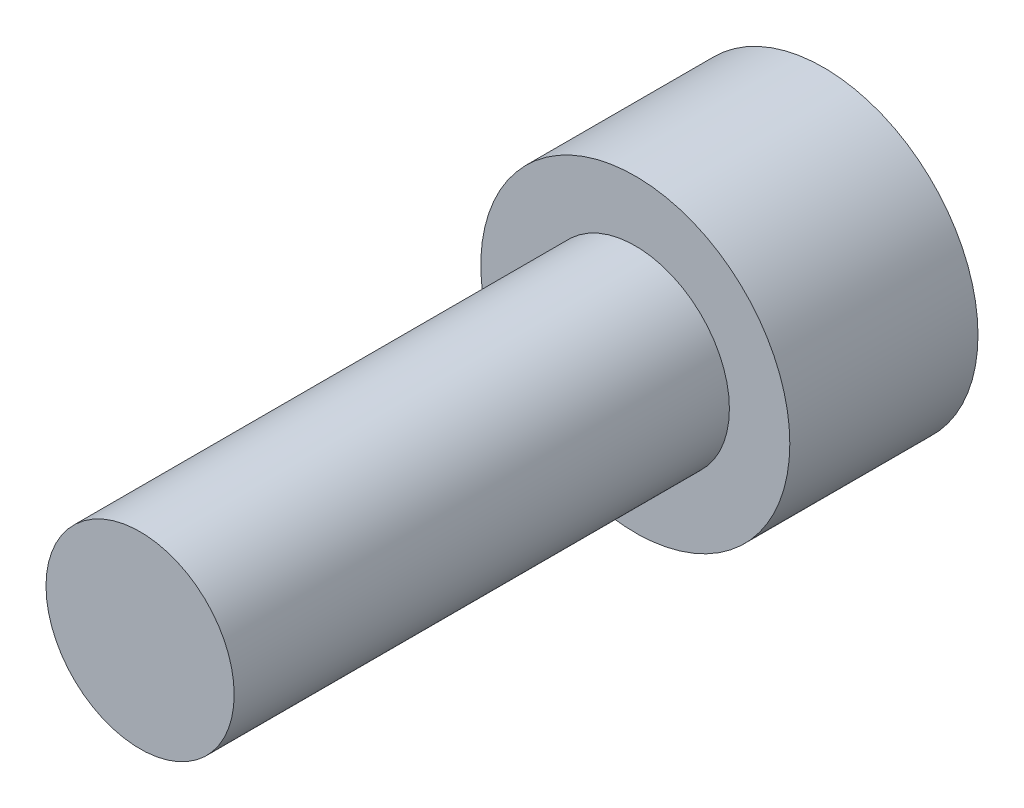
ISO-10303-21;
HEADER;
FILE_DESCRIPTION(('STEP AP214'),'2;1');
FILE_NAME('part.step','',(''),(''),'','','');
FILE_SCHEMA(('AUTOMOTIVE_DESIGN { 1 0 10303 214 1 1 1 1 }'));
ENDSEC;
DATA;
#1=APPLICATION_CONTEXT('core data for automotive mechanical design processes');
#2=APPLICATION_PROTOCOL_DEFINITION('international standard','automotive_design',2000,#1);
#3=PRODUCT_CONTEXT('',#1,'mechanical');
#4=PRODUCT('Part','Part','',(#3));
#5=PRODUCT_RELATED_PRODUCT_CATEGORY('part','',(#4));
#6=PRODUCT_DEFINITION_FORMATION('','',#4);
#7=PRODUCT_DEFINITION_CONTEXT('part definition',#1,'design');
#8=PRODUCT_DEFINITION('design','',#6,#7);
#9=PRODUCT_DEFINITION_SHAPE('','',#8);
#10=(LENGTH_UNIT() NAMED_UNIT(*) SI_UNIT(.MILLI.,.METRE.));
#11=(NAMED_UNIT(*) PLANE_ANGLE_UNIT() SI_UNIT($,.RADIAN.));
#12=(NAMED_UNIT(*) SI_UNIT($,.STERADIAN.) SOLID_ANGLE_UNIT());
#13=UNCERTAINTY_MEASURE_WITH_UNIT(LENGTH_MEASURE(1.E-05),#10,'distance_accuracy_value','');
#14=(GEOMETRIC_REPRESENTATION_CONTEXT(3) GLOBAL_UNCERTAINTY_ASSIGNED_CONTEXT((#13)) GLOBAL_UNIT_ASSIGNED_CONTEXT((#10,
#11,#12)) REPRESENTATION_CONTEXT('',''));
#15=CARTESIAN_POINT('',(0.,0.,0.));
#16=DIRECTION('',(0.,0.,1.));
#17=DIRECTION('',(1.,0.,0.));
#18=AXIS2_PLACEMENT_3D('',#15,#16,#17);
#19=CARTESIAN_POINT('',(0.,0.,12.7));
#20=DIRECTION('',(0.,0.,1.));
#21=DIRECTION('',(1.,0.,0.));
#22=AXIS2_PLACEMENT_3D('',#19,#20,#21);
#23=PLANE('',#22);
#24=CARTESIAN_POINT('',(0.,0.,12.7));
#25=DIRECTION('',(0.,0.,1.));
#26=DIRECTION('',(1.,0.,0.));
#27=AXIS2_PLACEMENT_3D('',#24,#25,#26);
#28=CIRCLE('',#27,2.413);
#29=CARTESIAN_POINT('',(2.413,0.,12.7));
#30=VERTEX_POINT('',#29);
#31=EDGE_CURVE('E11',#30,#30,#28,.T.);
#32=ORIENTED_EDGE('',*,*,#31,.T.);
#33=EDGE_LOOP('',(#32));
#34=FACE_BOUND('',#33,.T.);
#35=ADVANCED_FACE('F37',(#34),#23,.T.);
#36=CARTESIAN_POINT('',(0.,0.,12.7));
#37=DIRECTION('',(0.,0.,1.));
#38=DIRECTION('',(1.,0.,0.));
#39=AXIS2_PLACEMENT_3D('',#36,#37,#38);
#40=CYLINDRICAL_SURFACE('',#39,2.413);
#41=CARTESIAN_POINT('',(0.,0.,0.));
#42=DIRECTION('',(0.,0.,1.));
#43=DIRECTION('',(1.,0.,0.));
#44=AXIS2_PLACEMENT_3D('',#41,#42,#43);
#45=CIRCLE('',#44,2.413);
#46=CARTESIAN_POINT('',(2.413,0.,0.));
#47=VERTEX_POINT('',#46);
#48=EDGE_CURVE('E44',#47,#47,#45,.T.);
#49=ORIENTED_EDGE('',*,*,#48,.T.);
#50=EDGE_LOOP('',(#49));
#51=FACE_BOUND('',#50,.T.);
#52=ORIENTED_EDGE('',*,*,#31,.F.);
#53=EDGE_LOOP('',(#52));
#54=FACE_BOUND('',#53,.T.);
#55=ADVANCED_FACE('F151',(#51,#54),#40,.T.);
#56=CARTESIAN_POINT('',(0.,-2.413,0.));
#57=DIRECTION('',(0.,0.,1.));
#58=DIRECTION('',(1.,0.,0.));
#59=AXIS2_PLACEMENT_3D('',#56,#57,#58);
#60=PLANE('',#59);
#61=CARTESIAN_POINT('',(0.,0.,0.));
#62=DIRECTION('',(0.,0.,1.));
#63=DIRECTION('',(1.,0.,0.));
#64=AXIS2_PLACEMENT_3D('',#61,#62,#63);
#65=CIRCLE('',#64,3.9624);
#66=CARTESIAN_POINT('',(3.9624,0.,0.));
#67=VERTEX_POINT('',#66);
#68=EDGE_CURVE('E146',#67,#67,#65,.T.);
#69=ORIENTED_EDGE('',*,*,#68,.T.);
#70=EDGE_LOOP('',(#69));
#71=FACE_BOUND('',#70,.T.);
#72=ORIENTED_EDGE('',*,*,#48,.F.);
#73=EDGE_LOOP('',(#72));
#74=FACE_BOUND('',#73,.T.);
#75=ADVANCED_FACE('F154',(#71,#74),#60,.T.);
#76=CARTESIAN_POINT('',(0.,0.,12.7));
#77=DIRECTION('',(0.,0.,1.));
#78=DIRECTION('',(1.,0.,0.));
#79=AXIS2_PLACEMENT_3D('',#76,#77,#78);
#80=CYLINDRICAL_SURFACE('',#79,3.9624);
#81=CARTESIAN_POINT('',(0.,0.,-4.826));
#82=DIRECTION('',(0.,0.,1.));
#83=DIRECTION('',(1.,0.,0.));
#84=AXIS2_PLACEMENT_3D('',#81,#82,#83);
#85=CIRCLE('',#84,3.9624);
#86=CARTESIAN_POINT('',(3.9624,0.,-4.826));
#87=VERTEX_POINT('',#86);
#88=EDGE_CURVE('E138',#87,#87,#85,.T.);
#89=ORIENTED_EDGE('',*,*,#88,.T.);
#90=EDGE_LOOP('',(#89));
#91=FACE_BOUND('',#90,.T.);
#92=ORIENTED_EDGE('',*,*,#68,.F.);
#93=EDGE_LOOP('',(#92));
#94=FACE_BOUND('',#93,.T.);
#95=ADVANCED_FACE('F156',(#91,#94),#80,.T.);
#96=CARTESIAN_POINT('',(0.,-3.9624,-4.826));
#97=DIRECTION('',(0.,0.,-1.));
#98=DIRECTION('',(-1.,0.,0.));
#99=AXIS2_PLACEMENT_3D('',#96,#97,#98);
#100=PLANE('',#99);
#101=DIRECTION('',(0.866025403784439,-0.5,0.));
#102=VECTOR('',#101,1.);
#103=CARTESIAN_POINT('',(0.,2.28769270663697,-4.826));
#104=LINE('',#103,#102);
#105=CARTESIAN_POINT('',(0.,2.28769270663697,-4.826));
#106=VERTEX_POINT('',#105);
#107=CARTESIAN_POINT('',(1.9812,1.14384635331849,-4.826));
#108=VERTEX_POINT('',#107);
#109=EDGE_CURVE('E51',#106,#108,#104,.T.);
#110=ORIENTED_EDGE('',*,*,#109,.F.);
#111=DIRECTION('',(0.866025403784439,0.5,0.));
#112=VECTOR('',#111,1.);
#113=CARTESIAN_POINT('',(-1.9812,1.14384635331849,-4.826));
#114=LINE('',#113,#112);
#115=CARTESIAN_POINT('',(-1.9812,1.14384635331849,-4.826));
#116=VERTEX_POINT('',#115);
#117=EDGE_CURVE('E134',#116,#106,#114,.T.);
#118=ORIENTED_EDGE('',*,*,#117,.F.);
#119=DIRECTION('',(0.,1.,0.));
#120=VECTOR('',#119,1.);
#121=CARTESIAN_POINT('',(-1.9812,-1.14384635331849,-4.826));
#122=LINE('',#121,#120);
#123=CARTESIAN_POINT('',(-1.9812,-1.14384635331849,-4.826));
#124=VERTEX_POINT('',#123);
#125=EDGE_CURVE('E132',#124,#116,#122,.T.);
#126=ORIENTED_EDGE('',*,*,#125,.F.);
#127=DIRECTION('',(-0.866025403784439,0.5,0.));
#128=VECTOR('',#127,1.);
#129=CARTESIAN_POINT('',(0.,-2.28769270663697,-4.826));
#130=LINE('',#129,#128);
#131=CARTESIAN_POINT('',(0.,-2.28769270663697,-4.826));
#132=VERTEX_POINT('',#131);
#133=EDGE_CURVE('E99',#132,#124,#130,.T.);
#134=ORIENTED_EDGE('',*,*,#133,.F.);
#135=DIRECTION('',(-0.866025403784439,-0.5,0.));
#136=VECTOR('',#135,1.);
#137=CARTESIAN_POINT('',(1.9812,-1.14384635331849,-4.826));
#138=LINE('',#137,#136);
#139=CARTESIAN_POINT('',(1.9812,-1.14384635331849,-4.826));
#140=VERTEX_POINT('',#139);
#141=EDGE_CURVE('E128',#140,#132,#138,.T.);
#142=ORIENTED_EDGE('',*,*,#141,.F.);
#143=DIRECTION('',(0.,-1.,0.));
#144=VECTOR('',#143,1.);
#145=CARTESIAN_POINT('',(1.9812,1.14384635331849,-4.826));
#146=LINE('',#145,#144);
#147=EDGE_CURVE('E125',#108,#140,#146,.T.);
#148=ORIENTED_EDGE('',*,*,#147,.F.);
#149=EDGE_LOOP('',(#110,#118,#126,#134,#142,#148));
#150=FACE_BOUND('',#149,.T.);
#151=ORIENTED_EDGE('',*,*,#88,.F.);
#152=EDGE_LOOP('',(#151));
#153=FACE_BOUND('',#152,.T.);
#154=ADVANCED_FACE('F163',(#150,#153),#100,.T.);
#155=CARTESIAN_POINT('',(0.,2.28769270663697,-1.778));
#156=DIRECTION('',(0.5,0.866025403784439,0.));
#157=DIRECTION('',(-0.866025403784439,0.5,0.));
#158=AXIS2_PLACEMENT_3D('',#155,#156,#157);
#159=PLANE('',#158);
#160=ORIENTED_EDGE('',*,*,#109,.T.);
#161=DIRECTION('',(0.,0.,-1.));
#162=VECTOR('',#161,1.);
#163=CARTESIAN_POINT('',(1.9812,1.14384635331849,-1.778));
#164=LINE('',#163,#162);
#165=CARTESIAN_POINT('',(1.9812,1.14384635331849,-1.778));
#166=VERTEX_POINT('',#165);
#167=EDGE_CURVE('E81',#166,#108,#164,.T.);
#168=ORIENTED_EDGE('',*,*,#167,.F.);
#169=DIRECTION('',(0.866025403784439,-0.5,0.));
#170=VECTOR('',#169,1.);
#171=CARTESIAN_POINT('',(0.,2.28769270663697,-1.778));
#172=LINE('',#171,#170);
#173=CARTESIAN_POINT('',(0.,2.28769270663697,-1.778));
#174=VERTEX_POINT('',#173);
#175=EDGE_CURVE('E136',#174,#166,#172,.T.);
#176=ORIENTED_EDGE('',*,*,#175,.F.);
#177=DIRECTION('',(0.,0.,-1.));
#178=VECTOR('',#177,1.);
#179=CARTESIAN_POINT('',(0.,2.28769270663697,-1.778));
#180=LINE('',#179,#178);
#181=EDGE_CURVE('E59',#174,#106,#180,.T.);
#182=ORIENTED_EDGE('',*,*,#181,.T.);
#183=EDGE_LOOP('',(#160,#168,#176,#182));
#184=FACE_BOUND('',#183,.T.);
#185=ADVANCED_FACE('F197',(#184),#159,.F.);
#186=CARTESIAN_POINT('',(-1.9812,1.14384635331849,-1.778));
#187=DIRECTION('',(-0.5,0.866025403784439,0.));
#188=DIRECTION('',(-0.866025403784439,-0.5,0.));
#189=AXIS2_PLACEMENT_3D('',#186,#187,#188);
#190=PLANE('',#189);
#191=ORIENTED_EDGE('',*,*,#117,.T.);
#192=ORIENTED_EDGE('',*,*,#181,.F.);
#193=DIRECTION('',(0.866025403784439,0.5,0.));
#194=VECTOR('',#193,1.);
#195=CARTESIAN_POINT('',(-1.9812,1.14384635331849,-1.778));
#196=LINE('',#195,#194);
#197=CARTESIAN_POINT('',(-1.9812,1.14384635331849,-1.778));
#198=VERTEX_POINT('',#197);
#199=EDGE_CURVE('E111',#198,#174,#196,.T.);
#200=ORIENTED_EDGE('',*,*,#199,.F.);
#201=DIRECTION('',(0.,0.,-1.));
#202=VECTOR('',#201,1.);
#203=CARTESIAN_POINT('',(-1.9812,1.14384635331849,-1.778));
#204=LINE('',#203,#202);
#205=EDGE_CURVE('E103',#198,#116,#204,.T.);
#206=ORIENTED_EDGE('',*,*,#205,.T.);
#207=EDGE_LOOP('',(#191,#192,#200,#206));
#208=FACE_BOUND('',#207,.T.);
#209=ADVANCED_FACE('F208',(#208),#190,.F.);
#210=CARTESIAN_POINT('',(-1.9812,-1.14384635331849,-1.778));
#211=DIRECTION('',(-1.,0.,0.));
#212=DIRECTION('',(0.,-1.,0.));
#213=AXIS2_PLACEMENT_3D('',#210,#211,#212);
#214=PLANE('',#213);
#215=ORIENTED_EDGE('',*,*,#125,.T.);
#216=ORIENTED_EDGE('',*,*,#205,.F.);
#217=DIRECTION('',(0.,1.,0.));
#218=VECTOR('',#217,1.);
#219=CARTESIAN_POINT('',(-1.9812,-1.14384635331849,-1.778));
#220=LINE('',#219,#218);
#221=CARTESIAN_POINT('',(-1.9812,-1.14384635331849,-1.778));
#222=VERTEX_POINT('',#221);
#223=EDGE_CURVE('E107',#222,#198,#220,.T.);
#224=ORIENTED_EDGE('',*,*,#223,.F.);
#225=DIRECTION('',(0.,0.,-1.));
#226=VECTOR('',#225,1.);
#227=CARTESIAN_POINT('',(-1.9812,-1.14384635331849,-1.778));
#228=LINE('',#227,#226);
#229=EDGE_CURVE('E92',#222,#124,#228,.T.);
#230=ORIENTED_EDGE('',*,*,#229,.T.);
#231=EDGE_LOOP('',(#215,#216,#224,#230));
#232=FACE_BOUND('',#231,.T.);
#233=ADVANCED_FACE('F108',(#232),#214,.F.);
#234=CARTESIAN_POINT('',(0.,-2.28769270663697,-1.778));
#235=DIRECTION('',(-0.5,-0.866025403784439,0.));
#236=DIRECTION('',(0.866025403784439,-0.5,0.));
#237=AXIS2_PLACEMENT_3D('',#234,#235,#236);
#238=PLANE('',#237);
#239=ORIENTED_EDGE('',*,*,#133,.T.);
#240=ORIENTED_EDGE('',*,*,#229,.F.);
#241=DIRECTION('',(-0.866025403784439,0.5,0.));
#242=VECTOR('',#241,1.);
#243=CARTESIAN_POINT('',(0.,-2.28769270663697,-1.778));
#244=LINE('',#243,#242);
#245=CARTESIAN_POINT('',(0.,-2.28769270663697,-1.778));
#246=VERTEX_POINT('',#245);
#247=EDGE_CURVE('E96',#246,#222,#244,.T.);
#248=ORIENTED_EDGE('',*,*,#247,.F.);
#249=DIRECTION('',(0.,0.,-1.));
#250=VECTOR('',#249,1.);
#251=CARTESIAN_POINT('',(0.,-2.28769270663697,-1.778));
#252=LINE('',#251,#250);
#253=EDGE_CURVE('E104',#246,#132,#252,.T.);
#254=ORIENTED_EDGE('',*,*,#253,.T.);
#255=EDGE_LOOP('',(#239,#240,#248,#254));
#256=FACE_BOUND('',#255,.T.);
#257=ADVANCED_FACE('F94',(#256),#238,.F.);
#258=CARTESIAN_POINT('',(1.9812,-1.14384635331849,-1.778));
#259=DIRECTION('',(0.5,-0.866025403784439,0.));
#260=DIRECTION('',(0.866025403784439,0.5,0.));
#261=AXIS2_PLACEMENT_3D('',#258,#259,#260);
#262=PLANE('',#261);
#263=ORIENTED_EDGE('',*,*,#141,.T.);
#264=ORIENTED_EDGE('',*,*,#253,.F.);
#265=DIRECTION('',(-0.866025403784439,-0.5,0.));
#266=VECTOR('',#265,1.);
#267=CARTESIAN_POINT('',(1.9812,-1.14384635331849,-1.778));
#268=LINE('',#267,#266);
#269=CARTESIAN_POINT('',(1.9812,-1.14384635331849,-1.778));
#270=VERTEX_POINT('',#269);
#271=EDGE_CURVE('E117',#270,#246,#268,.T.);
#272=ORIENTED_EDGE('',*,*,#271,.F.);
#273=DIRECTION('',(0.,0.,-1.));
#274=VECTOR('',#273,1.);
#275=CARTESIAN_POINT('',(1.9812,-1.14384635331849,-1.778));
#276=LINE('',#275,#274);
#277=EDGE_CURVE('E141',#270,#140,#276,.T.);
#278=ORIENTED_EDGE('',*,*,#277,.T.);
#279=EDGE_LOOP('',(#263,#264,#272,#278));
#280=FACE_BOUND('',#279,.T.);
#281=ADVANCED_FACE('F236',(#280),#262,.F.);
#282=CARTESIAN_POINT('',(1.9812,1.14384635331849,-1.778));
#283=DIRECTION('',(1.,0.,0.));
#284=DIRECTION('',(0.,0.,-1.));
#285=AXIS2_PLACEMENT_3D('',#282,#283,#284);
#286=PLANE('',#285);
#287=ORIENTED_EDGE('',*,*,#147,.T.);
#288=ORIENTED_EDGE('',*,*,#277,.F.);
#289=DIRECTION('',(0.,-1.,0.));
#290=VECTOR('',#289,1.);
#291=CARTESIAN_POINT('',(1.9812,1.14384635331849,-1.778));
#292=LINE('',#291,#290);
#293=EDGE_CURVE('E119',#166,#270,#292,.T.);
#294=ORIENTED_EDGE('',*,*,#293,.F.);
#295=ORIENTED_EDGE('',*,*,#167,.T.);
#296=EDGE_LOOP('',(#287,#288,#294,#295));
#297=FACE_BOUND('',#296,.T.);
#298=ADVANCED_FACE('F246',(#297),#286,.F.);
#299=CARTESIAN_POINT('',(3.9624,0.,-1.778));
#300=DIRECTION('',(0.,0.,-1.));
#301=DIRECTION('',(-1.,0.,0.));
#302=AXIS2_PLACEMENT_3D('',#299,#300,#301);
#303=PLANE('',#302);
#304=ORIENTED_EDGE('',*,*,#175,.T.);
#305=ORIENTED_EDGE('',*,*,#293,.T.);
#306=ORIENTED_EDGE('',*,*,#271,.T.);
#307=ORIENTED_EDGE('',*,*,#247,.T.);
#308=ORIENTED_EDGE('',*,*,#223,.T.);
#309=ORIENTED_EDGE('',*,*,#199,.T.);
#310=EDGE_LOOP('',(#304,#305,#306,#307,#308,#309));
#311=FACE_BOUND('',#310,.T.);
#312=ADVANCED_FACE('F114',(#311),#303,.T.);
#313=CLOSED_SHELL('',(#35,#55,#75,#95,#154,#185,#209,#233,#257,#281,#298,#312));
#314=MANIFOLD_SOLID_BREP('B2',#313);
#315=ADVANCED_BREP_SHAPE_REPRESENTATION('',(#18,#314),#14);
#316=SHAPE_DEFINITION_REPRESENTATION(#9,#315);
ENDSEC;
END-ISO-10303-21;
